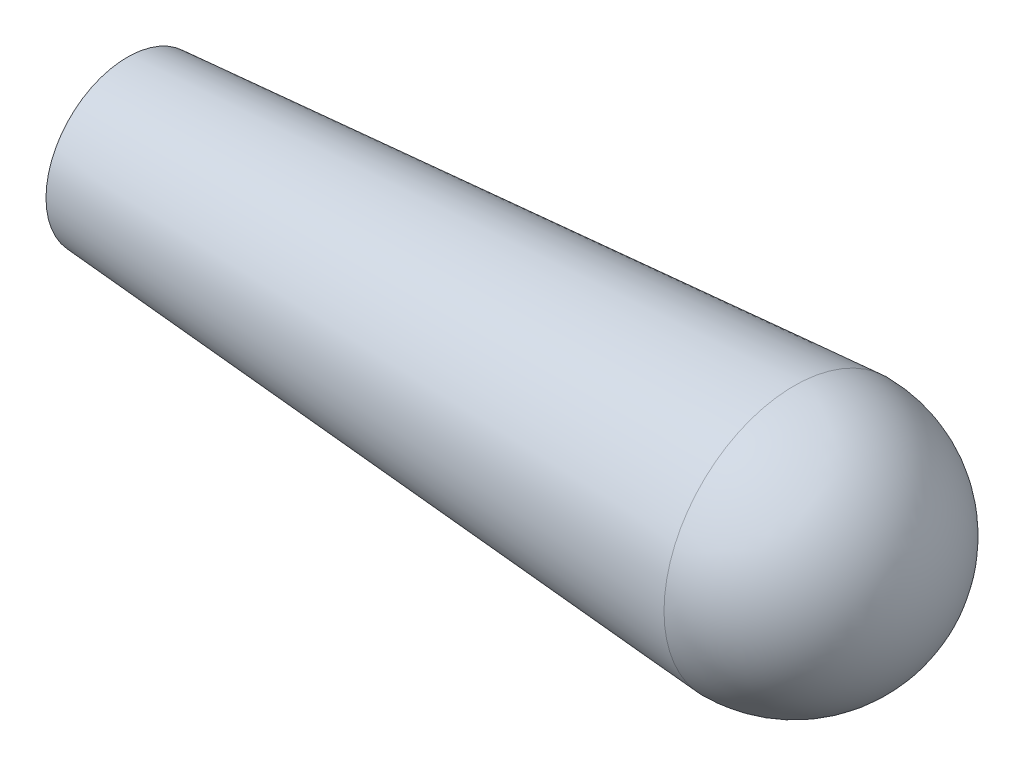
from build123d import *

# Parameters (mm, degrees)
SKETCH2_W          = 16
SKETCH2_H          = 6
CUT_EXTRUDE1_DEPTH = 78


with BuildPart() as part:
    # Sketch1 → Revolve2 (revolve)
    with BuildSketch(Plane.XY, mode=Mode.PRIVATE) as revolve2_sk:
        Polygon((-26.126008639, -10), (-26.126008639, 0), (55.873991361, 0), (55.873991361, -16), align=None)
        with BuildLine():
            Line((55.873991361, 0), (55.873991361, -16))
            ThreePointArc((55.873991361, -16), (67.18769986, -11.313708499), (71.873991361, 0))
            Line((71.873991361, 0), (55.873991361, 0))
        make_face()
    revolve(revolve2_sk.sketch.rotate(Axis((-26.126008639, 0, 0), (1, 0, 0)), 270), axis=Axis((-26.126008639, 0, 0), (1, 0, 0)))

    # Sketch2 → Cut-Extrude1 (cut)
    with BuildSketch(Plane.ZY.offset(26.126008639)):
        Rectangle(SKETCH2_W, SKETCH2_H)
    extrude(amount=-CUT_EXTRUDE1_DEPTH, mode=Mode.SUBTRACT)


solid = part.part
